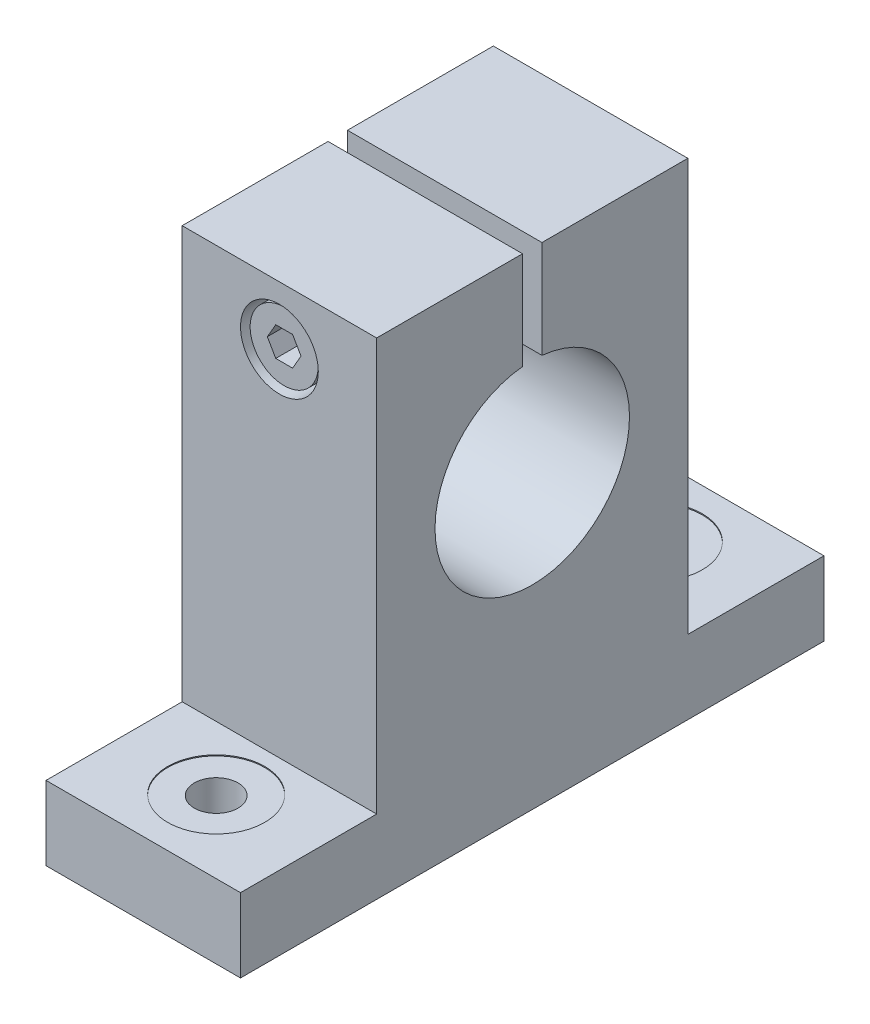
ISO-10303-21;
HEADER;
FILE_DESCRIPTION(('STEP AP214'),'2;1');
FILE_NAME('part.step','',(''),(''),'','','');
FILE_SCHEMA(('AUTOMOTIVE_DESIGN { 1 0 10303 214 1 1 1 1 }'));
ENDSEC;
DATA;
#1=APPLICATION_CONTEXT('core data for automotive mechanical design processes');
#2=APPLICATION_PROTOCOL_DEFINITION('international standard','automotive_design',2000,#1);
#3=PRODUCT_CONTEXT('',#1,'mechanical');
#4=PRODUCT('Part','Part','',(#3));
#5=PRODUCT_RELATED_PRODUCT_CATEGORY('part','',(#4));
#6=PRODUCT_DEFINITION_FORMATION('','',#4);
#7=PRODUCT_DEFINITION_CONTEXT('part definition',#1,'design');
#8=PRODUCT_DEFINITION('design','',#6,#7);
#9=PRODUCT_DEFINITION_SHAPE('','',#8);
#10=(LENGTH_UNIT() NAMED_UNIT(*) SI_UNIT(.MILLI.,.METRE.));
#11=(NAMED_UNIT(*) PLANE_ANGLE_UNIT() SI_UNIT($,.RADIAN.));
#12=(NAMED_UNIT(*) SI_UNIT($,.STERADIAN.) SOLID_ANGLE_UNIT());
#13=UNCERTAINTY_MEASURE_WITH_UNIT(LENGTH_MEASURE(1.E-05),#10,'distance_accuracy_value','');
#14=(GEOMETRIC_REPRESENTATION_CONTEXT(3) GLOBAL_UNCERTAINTY_ASSIGNED_CONTEXT((#13)) GLOBAL_UNIT_ASSIGNED_CONTEXT((#10,
#11,#12)) REPRESENTATION_CONTEXT('',''));
#15=CARTESIAN_POINT('',(0.,0.,0.));
#16=DIRECTION('',(0.,0.,1.));
#17=DIRECTION('',(1.,0.,0.));
#18=AXIS2_PLACEMENT_3D('',#15,#16,#17);
#19=CARTESIAN_POINT('',(-1.73205080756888,14.,15.51));
#20=DIRECTION('',(0.866025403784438,0.500000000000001,0.));
#21=DIRECTION('',(0.500000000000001,-0.866025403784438,0.));
#22=AXIS2_PLACEMENT_3D('',#19,#20,#21);
#23=PLANE('',#22);
#24=DIRECTION('',(0.500000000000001,-0.866025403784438,0.));
#25=VECTOR('',#24,1.);
#26=CARTESIAN_POINT('',(-1.29903810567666,13.25,15.51));
#27=LINE('',#26,#25);
#28=CARTESIAN_POINT('',(-1.73205068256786,13.9999997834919,15.51));
#29=VERTEX_POINT('',#28);
#30=CARTESIAN_POINT('',(-0.86602540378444,12.5,15.51));
#31=VERTEX_POINT('',#30);
#32=EDGE_CURVE('E580',#29,#31,#27,.T.);
#33=ORIENTED_EDGE('',*,*,#32,.T.);
#34=DIRECTION('',(0.,0.,-1.));
#35=VECTOR('',#34,1.);
#36=CARTESIAN_POINT('',(-0.86602540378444,12.5,15.51));
#37=LINE('',#36,#35);
#38=CARTESIAN_POINT('',(-0.86602540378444,12.5,12.8433333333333));
#39=VERTEX_POINT('',#38);
#40=EDGE_CURVE('E583',#39,#31,#37,.F.);
#41=ORIENTED_EDGE('',*,*,#40,.F.);
#42=DIRECTION('',(-0.500000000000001,0.866025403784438,0.));
#43=VECTOR('',#42,1.);
#44=CARTESIAN_POINT('',(-1.29903810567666,13.25,12.8433333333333));
#45=LINE('',#44,#43);
#46=CARTESIAN_POINT('',(-1.73205077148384,14.0000000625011,12.8433333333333));
#47=VERTEX_POINT('',#46);
#48=EDGE_CURVE('E588',#39,#47,#45,.T.);
#49=ORIENTED_EDGE('',*,*,#48,.T.);
#50=DIRECTION('',(0.,0.,-1.));
#51=VECTOR('',#50,1.);
#52=CARTESIAN_POINT('',(-1.73205080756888,14.,15.51));
#53=LINE('',#52,#51);
#54=EDGE_CURVE('E586',#29,#47,#53,.T.);
#55=ORIENTED_EDGE('',*,*,#54,.F.);
#56=EDGE_LOOP('',(#33,#41,#49,#55));
#57=FACE_BOUND('',#56,.T.);
#58=ADVANCED_FACE('F16',(#57),#23,.T.);
#59=CARTESIAN_POINT('',(-0.86602540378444,12.5,15.51));
#60=DIRECTION('',(0.,1.,0.));
#61=DIRECTION('',(1.,0.,0.));
#62=AXIS2_PLACEMENT_3D('',#59,#60,#61);
#63=PLANE('',#62);
#64=DIRECTION('',(1.,0.,0.));
#65=VECTOR('',#64,1.);
#66=CARTESIAN_POINT('',(0.,12.5,15.51));
#67=LINE('',#66,#65);
#68=CARTESIAN_POINT('',(0.86602540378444,12.5,15.51));
#69=VERTEX_POINT('',#68);
#70=EDGE_CURVE('E590',#31,#69,#67,.T.);
#71=ORIENTED_EDGE('',*,*,#70,.T.);
#72=DIRECTION('',(0.,0.,-1.));
#73=VECTOR('',#72,1.);
#74=CARTESIAN_POINT('',(0.86602540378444,12.5,15.51));
#75=LINE('',#74,#73);
#76=CARTESIAN_POINT('',(0.86602540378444,12.5,12.8433333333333));
#77=VERTEX_POINT('',#76);
#78=EDGE_CURVE('E657',#77,#69,#75,.F.);
#79=ORIENTED_EDGE('',*,*,#78,.F.);
#80=DIRECTION('',(1.,0.,0.));
#81=VECTOR('',#80,1.);
#82=CARTESIAN_POINT('',(0.,12.5,12.8433333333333));
#83=LINE('',#82,#81);
#84=EDGE_CURVE('E599',#39,#77,#83,.T.);
#85=ORIENTED_EDGE('',*,*,#84,.F.);
#86=ORIENTED_EDGE('',*,*,#40,.T.);
#87=EDGE_LOOP('',(#71,#79,#85,#86));
#88=FACE_BOUND('',#87,.T.);
#89=ADVANCED_FACE('F598',(#88),#63,.T.);
#90=CARTESIAN_POINT('',(-0.86602540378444,15.5,15.51));
#91=DIRECTION('',(0.866025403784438,-0.500000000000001,0.));
#92=DIRECTION('',(-0.500000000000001,-0.866025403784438,0.));
#93=AXIS2_PLACEMENT_3D('',#90,#91,#92);
#94=PLANE('',#93);
#95=DIRECTION('',(-0.500000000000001,-0.866025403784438,0.));
#96=VECTOR('',#95,1.);
#97=CARTESIAN_POINT('',(-1.29903810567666,14.75,15.51));
#98=LINE('',#97,#96);
#99=CARTESIAN_POINT('',(-0.86602540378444,15.5,15.51));
#100=VERTEX_POINT('',#99);
#101=EDGE_CURVE('E596',#100,#29,#98,.T.);
#102=ORIENTED_EDGE('',*,*,#101,.T.);
#103=ORIENTED_EDGE('',*,*,#54,.T.);
#104=CARTESIAN_POINT('',(-0.86602540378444,15.5,12.8433333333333));
#105=CARTESIAN_POINT('',(-0.902109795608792,15.4375,12.8433333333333));
#106=CARTESIAN_POINT('',(-0.938194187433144,15.375,12.8433333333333));
#107=CARTESIAN_POINT('',(-1.01036297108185,15.25,12.8433333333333));
#108=CARTESIAN_POINT('',(-1.0464473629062,15.1875,12.8433333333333));
#109=CARTESIAN_POINT('',(-1.1186161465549,15.0625,12.8433333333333));
#110=CARTESIAN_POINT('',(-1.15470053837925,15.,12.8433333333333));
#111=CARTESIAN_POINT('',(-1.22686932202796,14.875,12.8433333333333));
#112=CARTESIAN_POINT('',(-1.26295371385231,14.8125,12.8433333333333));
#113=CARTESIAN_POINT('',(-1.33512249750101,14.6875,12.8433333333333));
#114=CARTESIAN_POINT('',(-1.37120688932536,14.625,12.8433333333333));
#115=CARTESIAN_POINT('',(-1.44337567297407,14.5,12.8433333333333));
#116=CARTESIAN_POINT('',(-1.47946006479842,14.4375,12.8433333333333));
#117=CARTESIAN_POINT('',(-1.55162884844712,14.3125,12.8433333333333));
#118=CARTESIAN_POINT('',(-1.58771324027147,14.25,12.8433333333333));
#119=CARTESIAN_POINT('',(-1.65988202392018,14.125,12.8433333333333));
#120=CARTESIAN_POINT('',(-1.69596641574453,14.0625,12.8433333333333));
#121=CARTESIAN_POINT('',(-1.73205080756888,14.,12.8433333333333));
#122=B_SPLINE_CURVE_WITH_KNOTS('',3,(#104,#105,#106,#107,#108,#109,#110,#111,#112,#113,#114,
#115,#116,#117,#118,#119,#120,#121),.UNSPECIFIED.,.F.,.F.,(4,2,2,2,2,2,2,2,4),(0.,
0.21650635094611,0.43301270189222,0.64951905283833,0.86602540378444,1.08253175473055,
1.29903810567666,1.51554445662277,1.73205080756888),.UNSPECIFIED.);
#123=CARTESIAN_POINT('',(-0.86602540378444,15.5,12.8433333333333));
#124=VERTEX_POINT('',#123);
#125=EDGE_CURVE('E604',#124,#47,#122,.T.);
#126=ORIENTED_EDGE('',*,*,#125,.F.);
#127=DIRECTION('',(0.,0.,-1.));
#128=VECTOR('',#127,1.);
#129=CARTESIAN_POINT('',(-0.86602540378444,15.5,15.51));
#130=LINE('',#129,#128);
#131=EDGE_CURVE('E642',#100,#124,#130,.T.);
#132=ORIENTED_EDGE('',*,*,#131,.F.);
#133=EDGE_LOOP('',(#102,#103,#126,#132));
#134=FACE_BOUND('',#133,.T.);
#135=ADVANCED_FACE('F619',(#134),#94,.T.);
#136=CARTESIAN_POINT('',(-1.73205080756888,12.5,12.8433333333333));
#137=DIRECTION('',(0.,0.,1.));
#138=DIRECTION('',(1.,0.,0.));
#139=AXIS2_PLACEMENT_3D('',#136,#137,#138);
#140=PLANE('',#139);
#141=ORIENTED_EDGE('',*,*,#48,.F.);
#142=ORIENTED_EDGE('',*,*,#84,.T.);
#143=DIRECTION('',(-0.500000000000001,-0.866025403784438,0.));
#144=VECTOR('',#143,1.);
#145=CARTESIAN_POINT('',(1.29903810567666,13.25,12.8433333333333));
#146=LINE('',#145,#144);
#147=CARTESIAN_POINT('',(1.7320507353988,13.9999998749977,12.8433333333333));
#148=VERTEX_POINT('',#147);
#149=EDGE_CURVE('E656',#148,#77,#146,.T.);
#150=ORIENTED_EDGE('',*,*,#149,.F.);
#151=DIRECTION('',(0.500000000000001,-0.866025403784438,0.));
#152=VECTOR('',#151,1.);
#153=CARTESIAN_POINT('',(1.29903810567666,14.75,12.8433333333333));
#154=LINE('',#153,#152);
#155=CARTESIAN_POINT('',(0.86602540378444,15.5,12.8433333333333));
#156=VERTEX_POINT('',#155);
#157=EDGE_CURVE('E645',#156,#148,#154,.T.);
#158=ORIENTED_EDGE('',*,*,#157,.F.);
#159=DIRECTION('',(1.,0.,0.));
#160=VECTOR('',#159,1.);
#161=CARTESIAN_POINT('',(0.,15.5,12.8433333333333));
#162=LINE('',#161,#160);
#163=EDGE_CURVE('E643',#124,#156,#162,.T.);
#164=ORIENTED_EDGE('',*,*,#163,.F.);
#165=ORIENTED_EDGE('',*,*,#125,.T.);
#166=EDGE_LOOP('',(#141,#142,#150,#158,#164,#165));
#167=FACE_BOUND('',#166,.T.);
#168=ADVANCED_FACE('F621',(#167),#140,.T.);
#169=CARTESIAN_POINT('',(0.86602540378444,12.5,15.51));
#170=DIRECTION('',(-0.866025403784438,0.500000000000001,0.));
#171=DIRECTION('',(0.500000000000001,0.866025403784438,0.));
#172=AXIS2_PLACEMENT_3D('',#169,#170,#171);
#173=PLANE('',#172);
#174=DIRECTION('',(0.500000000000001,0.866025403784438,0.));
#175=VECTOR('',#174,1.);
#176=CARTESIAN_POINT('',(1.29903810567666,13.25,15.51));
#177=LINE('',#176,#175);
#178=CARTESIAN_POINT('',(1.73205074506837,13.9999998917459,15.51));
#179=VERTEX_POINT('',#178);
#180=EDGE_CURVE('E592',#69,#179,#177,.T.);
#181=ORIENTED_EDGE('',*,*,#180,.T.);
#182=DIRECTION('',(0.,0.,-1.));
#183=VECTOR('',#182,1.);
#184=CARTESIAN_POINT('',(1.73205080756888,14.,15.51));
#185=LINE('',#184,#183);
#186=EDGE_CURVE('E343',#148,#179,#185,.F.);
#187=ORIENTED_EDGE('',*,*,#186,.F.);
#188=ORIENTED_EDGE('',*,*,#149,.T.);
#189=ORIENTED_EDGE('',*,*,#78,.T.);
#190=EDGE_LOOP('',(#181,#187,#188,#189));
#191=FACE_BOUND('',#190,.T.);
#192=ADVANCED_FACE('F624',(#191),#173,.T.);
#193=CARTESIAN_POINT('',(0.86602540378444,15.5,15.51));
#194=DIRECTION('',(0.,-1.,0.));
#195=DIRECTION('',(-1.,0.,0.));
#196=AXIS2_PLACEMENT_3D('',#193,#194,#195);
#197=PLANE('',#196);
#198=DIRECTION('',(-1.,0.,0.));
#199=VECTOR('',#198,1.);
#200=CARTESIAN_POINT('',(0.,15.5,15.51));
#201=LINE('',#200,#199);
#202=CARTESIAN_POINT('',(0.86602540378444,15.5,15.51));
#203=VERTEX_POINT('',#202);
#204=EDGE_CURVE('E639',#203,#100,#201,.T.);
#205=ORIENTED_EDGE('',*,*,#204,.T.);
#206=ORIENTED_EDGE('',*,*,#131,.T.);
#207=ORIENTED_EDGE('',*,*,#163,.T.);
#208=DIRECTION('',(0.,0.,-1.));
#209=VECTOR('',#208,1.);
#210=CARTESIAN_POINT('',(0.86602540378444,15.5,15.51));
#211=LINE('',#210,#209);
#212=EDGE_CURVE('E335',#203,#156,#211,.T.);
#213=ORIENTED_EDGE('',*,*,#212,.F.);
#214=EDGE_LOOP('',(#205,#206,#207,#213));
#215=FACE_BOUND('',#214,.T.);
#216=ADVANCED_FACE('F627',(#215),#197,.T.);
#217=CARTESIAN_POINT('',(1.73205080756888,14.,15.51));
#218=DIRECTION('',(-0.866025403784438,-0.500000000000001,0.));
#219=DIRECTION('',(-0.500000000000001,0.866025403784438,0.));
#220=AXIS2_PLACEMENT_3D('',#217,#218,#219);
#221=PLANE('',#220);
#222=CARTESIAN_POINT('',(0.86602540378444,15.5,15.51));
#223=CARTESIAN_POINT('',(0.902109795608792,15.4375,15.51));
#224=CARTESIAN_POINT('',(0.938194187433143,15.375,15.51));
#225=CARTESIAN_POINT('',(1.01036297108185,15.25,15.51));
#226=CARTESIAN_POINT('',(1.0464473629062,15.1875,15.51));
#227=CARTESIAN_POINT('',(1.1186161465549,15.0625,15.51));
#228=CARTESIAN_POINT('',(1.15470053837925,15.,15.51));
#229=CARTESIAN_POINT('',(1.22686932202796,14.875,15.51));
#230=CARTESIAN_POINT('',(1.26295371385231,14.8125,15.51));
#231=CARTESIAN_POINT('',(1.33512249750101,14.6875,15.51));
#232=CARTESIAN_POINT('',(1.37120688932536,14.625,15.51));
#233=CARTESIAN_POINT('',(1.44337567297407,14.5,15.51));
#234=CARTESIAN_POINT('',(1.47946006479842,14.4375,15.51));
#235=CARTESIAN_POINT('',(1.55162884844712,14.3125,15.51));
#236=CARTESIAN_POINT('',(1.58771324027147,14.25,15.51));
#237=CARTESIAN_POINT('',(1.65988202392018,14.125,15.51));
#238=CARTESIAN_POINT('',(1.69596641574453,14.0625,15.51));
#239=CARTESIAN_POINT('',(1.73205080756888,14.,15.51));
#240=B_SPLINE_CURVE_WITH_KNOTS('',3,(#222,#223,#224,#225,#226,#227,#228,#229,#230,#231,#232,
#233,#234,#235,#236,#237,#238,#239),.UNSPECIFIED.,.F.,.F.,(4,2,2,2,2,2,2,2,4),(0.,
0.21650635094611,0.43301270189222,0.64951905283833,0.866025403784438,1.08253175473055,
1.29903810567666,1.51554445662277,1.73205080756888),.UNSPECIFIED.);
#241=EDGE_CURVE('E331',#203,#179,#240,.T.);
#242=ORIENTED_EDGE('',*,*,#241,.F.);
#243=ORIENTED_EDGE('',*,*,#212,.T.);
#244=ORIENTED_EDGE('',*,*,#157,.T.);
#245=ORIENTED_EDGE('',*,*,#186,.T.);
#246=EDGE_LOOP('',(#242,#243,#244,#245));
#247=FACE_BOUND('',#246,.T.);
#248=ADVANCED_FACE('F362',(#247),#221,.T.);
#249=CARTESIAN_POINT('',(3.54200210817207,10.5,15.51));
#250=DIRECTION('',(0.,0.,1.));
#251=DIRECTION('',(0.,1.,0.));
#252=AXIS2_PLACEMENT_3D('',#249,#250,#251);
#253=PLANE('',#252);
#254=ORIENTED_EDGE('',*,*,#204,.F.);
#255=ORIENTED_EDGE('',*,*,#241,.T.);
#256=ORIENTED_EDGE('',*,*,#180,.F.);
#257=ORIENTED_EDGE('',*,*,#70,.F.);
#258=ORIENTED_EDGE('',*,*,#32,.F.);
#259=ORIENTED_EDGE('',*,*,#101,.F.);
#260=EDGE_LOOP('',(#254,#255,#256,#257,#258,#259));
#261=FACE_BOUND('',#260,.T.);
#262=CARTESIAN_POINT('',(0.,14.,15.51));
#263=DIRECTION('',(0.,0.,1.));
#264=DIRECTION('',(1.,0.,0.));
#265=AXIS2_PLACEMENT_3D('',#262,#263,#264);
#266=CIRCLE('',#265,3.5);
#267=CARTESIAN_POINT('',(3.5,14.,15.51));
#268=VERTEX_POINT('',#267);
#269=EDGE_CURVE('E20',#268,#268,#266,.F.);
#270=ORIENTED_EDGE('',*,*,#269,.F.);
#271=EDGE_LOOP('',(#270));
#272=FACE_BOUND('',#271,.T.);
#273=ADVANCED_FACE('F364',(#261,#272),#253,.T.);
#274=CARTESIAN_POINT('',(0.,14.,15.51));
#275=DIRECTION('',(0.,0.,1.));
#276=DIRECTION('',(1.,0.,0.));
#277=AXIS2_PLACEMENT_3D('',#274,#275,#276);
#278=CYLINDRICAL_SURFACE('',#277,3.5);
#279=ORIENTED_EDGE('',*,*,#269,.T.);
#280=EDGE_LOOP('',(#279));
#281=FACE_BOUND('',#280,.T.);
#282=CARTESIAN_POINT('',(0.,14.,11.511));
#283=DIRECTION('',(0.,0.,1.));
#284=DIRECTION('',(1.,0.,0.));
#285=AXIS2_PLACEMENT_3D('',#282,#283,#284);
#286=CIRCLE('',#285,3.5);
#287=CARTESIAN_POINT('',(3.5,14.,11.511));
#288=VERTEX_POINT('',#287);
#289=EDGE_CURVE('E326',#288,#288,#286,.F.);
#290=ORIENTED_EDGE('',*,*,#289,.F.);
#291=EDGE_LOOP('',(#290));
#292=FACE_BOUND('',#291,.T.);
#293=ADVANCED_FACE('F367',(#281,#292),#278,.T.);
#294=CARTESIAN_POINT('',(3.54200210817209,17.5,11.511));
#295=DIRECTION('',(0.,0.,-1.));
#296=DIRECTION('',(0.,-1.,0.));
#297=AXIS2_PLACEMENT_3D('',#294,#295,#296);
#298=PLANE('',#297);
#299=CARTESIAN_POINT('',(0.,14.,11.511));
#300=DIRECTION('',(0.,0.,1.));
#301=DIRECTION('',(1.,0.,0.));
#302=AXIS2_PLACEMENT_3D('',#299,#300,#301);
#303=CIRCLE('',#302,2.);
#304=CARTESIAN_POINT('',(2.,14.,11.511));
#305=VERTEX_POINT('',#304);
#306=EDGE_CURVE('E324',#305,#305,#303,.F.);
#307=ORIENTED_EDGE('',*,*,#306,.F.);
#308=EDGE_LOOP('',(#307));
#309=FACE_BOUND('',#308,.T.);
#310=ORIENTED_EDGE('',*,*,#289,.T.);
#311=EDGE_LOOP('',(#310));
#312=FACE_BOUND('',#311,.T.);
#313=ADVANCED_FACE('F370',(#309,#312),#298,.T.);
#314=CARTESIAN_POINT('',(1.61920421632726,15.6,-12.002));
#315=DIRECTION('',(0.,0.,-1.));
#316=DIRECTION('',(0.,-1.,0.));
#317=AXIS2_PLACEMENT_3D('',#314,#315,#316);
#318=PLANE('',#317);
#319=CARTESIAN_POINT('',(0.,14.,-12.002));
#320=DIRECTION('',(0.,0.,1.));
#321=DIRECTION('',(1.,0.,0.));
#322=AXIS2_PLACEMENT_3D('',#319,#320,#321);
#323=CIRCLE('',#322,1.6);
#324=CARTESIAN_POINT('',(1.6,14.,-12.002));
#325=VERTEX_POINT('',#324);
#326=EDGE_CURVE('E321',#325,#325,#323,.T.);
#327=ORIENTED_EDGE('',*,*,#326,.F.);
#328=EDGE_LOOP('',(#327));
#329=FACE_BOUND('',#328,.T.);
#330=ADVANCED_FACE('F373',(#329),#318,.T.);
#331=CARTESIAN_POINT('',(0.,14.,11.511));
#332=DIRECTION('',(0.,0.,1.));
#333=DIRECTION('',(1.,0.,0.));
#334=AXIS2_PLACEMENT_3D('',#331,#332,#333);
#335=CYLINDRICAL_SURFACE('',#334,2.);
#336=ORIENTED_EDGE('',*,*,#306,.T.);
#337=EDGE_LOOP('',(#336));
#338=FACE_BOUND('',#337,.T.);
#339=CARTESIAN_POINT('',(0.,14.,11.501));
#340=DIRECTION('',(0.,0.,1.));
#341=DIRECTION('',(1.,0.,0.));
#342=AXIS2_PLACEMENT_3D('',#339,#340,#341);
#343=CIRCLE('',#342,2.);
#344=CARTESIAN_POINT('',(2.,14.,11.501));
#345=VERTEX_POINT('',#344);
#346=EDGE_CURVE('E318',#345,#345,#343,.F.);
#347=ORIENTED_EDGE('',*,*,#346,.F.);
#348=EDGE_LOOP('',(#347));
#349=FACE_BOUND('',#348,.T.);
#350=ADVANCED_FACE('F377',(#338,#349),#335,.T.);
#351=CARTESIAN_POINT('',(5.,-16.,-11.));
#352=DIRECTION('',(0.,-1.,0.));
#353=DIRECTION('',(0.,0.,1.));
#354=AXIS2_PLACEMENT_3D('',#351,#352,#353);
#355=PLANE('',#354);
#356=DIRECTION('',(0.,0.,-1.));
#357=VECTOR('',#356,1.);
#358=CARTESIAN_POINT('',(5.,-16.,0.));
#359=LINE('',#358,#357);
#360=CARTESIAN_POINT('',(5.,-16.,11.));
#361=VERTEX_POINT('',#360);
#362=CARTESIAN_POINT('',(5.,-16.,-11.));
#363=VERTEX_POINT('',#362);
#364=EDGE_CURVE('E1599',#361,#363,#359,.T.);
#365=ORIENTED_EDGE('',*,*,#364,.F.);
#366=DIRECTION('',(-1.,0.,0.));
#367=VECTOR('',#366,1.);
#368=CARTESIAN_POINT('',(5.,-16.,11.));
#369=LINE('',#368,#367);
#370=CARTESIAN_POINT('',(-5.,-16.,11.));
#371=VERTEX_POINT('',#370);
#372=EDGE_CURVE('E314',#371,#361,#369,.F.);
#373=ORIENTED_EDGE('',*,*,#372,.F.);
#374=DIRECTION('',(0.,0.,1.));
#375=VECTOR('',#374,1.);
#376=CARTESIAN_POINT('',(-5.,-16.,0.));
#377=LINE('',#376,#375);
#378=CARTESIAN_POINT('',(-5.,-16.,-11.));
#379=VERTEX_POINT('',#378);
#380=EDGE_CURVE('E1612',#379,#371,#377,.T.);
#381=ORIENTED_EDGE('',*,*,#380,.F.);
#382=DIRECTION('',(-1.,0.,0.));
#383=VECTOR('',#382,1.);
#384=CARTESIAN_POINT('',(5.,-16.,-11.));
#385=LINE('',#384,#383);
#386=EDGE_CURVE('E1600',#363,#379,#385,.T.);
#387=ORIENTED_EDGE('',*,*,#386,.F.);
#388=EDGE_LOOP('',(#365,#373,#381,#387));
#389=FACE_BOUND('',#388,.T.);
#390=ADVANCED_FACE('F381',(#389),#355,.T.);
#391=CARTESIAN_POINT('',(5.04988210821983,-22.5,-17.51));
#392=DIRECTION('',(0.,1.,0.));
#393=DIRECTION('',(0.,0.,-1.));
#394=AXIS2_PLACEMENT_3D('',#391,#392,#393);
#395=PLANE('',#394);
#396=CARTESIAN_POINT('',(0.,-22.5,-22.5));
#397=DIRECTION('',(0.,-1.,0.));
#398=DIRECTION('',(0.,0.,-1.));
#399=AXIS2_PLACEMENT_3D('',#396,#397,#398);
#400=CIRCLE('',#399,2.25);
#401=CARTESIAN_POINT('',(0.,-22.5,-24.75));
#402=VERTEX_POINT('',#401);
#403=EDGE_CURVE('E315',#402,#402,#400,.F.);
#404=ORIENTED_EDGE('',*,*,#403,.F.);
#405=EDGE_LOOP('',(#404));
#406=FACE_BOUND('',#405,.T.);
#407=CARTESIAN_POINT('',(0.,-22.5,-22.5));
#408=DIRECTION('',(0.,-1.,0.));
#409=DIRECTION('',(0.,0.,-1.));
#410=AXIS2_PLACEMENT_3D('',#407,#408,#409);
#411=CIRCLE('',#410,4.99);
#412=CARTESIAN_POINT('',(0.,-22.5,-27.49));
#413=VERTEX_POINT('',#412);
#414=EDGE_CURVE('E279',#413,#413,#411,.T.);
#415=ORIENTED_EDGE('',*,*,#414,.F.);
#416=EDGE_LOOP('',(#415));
#417=FACE_BOUND('',#416,.T.);
#418=ADVANCED_FACE('F385',(#406,#417),#395,.T.);
#419=CARTESIAN_POINT('',(0.,14.,-15.601));
#420=DIRECTION('',(0.,0.,1.));
#421=DIRECTION('',(1.,0.,0.));
#422=AXIS2_PLACEMENT_3D('',#419,#420,#421);
#423=CYLINDRICAL_SURFACE('',#422,1.6);
#424=ORIENTED_EDGE('',*,*,#326,.T.);
#425=EDGE_LOOP('',(#424));
#426=FACE_BOUND('',#425,.T.);
#427=CARTESIAN_POINT('',(0.,14.,-15.601));
#428=DIRECTION('',(0.,0.,1.));
#429=DIRECTION('',(0.,1.,0.));
#430=AXIS2_PLACEMENT_3D('',#427,#428,#429);
#431=CIRCLE('',#430,1.6);
#432=CARTESIAN_POINT('',(0.,15.6,-15.601));
#433=VERTEX_POINT('',#432);
#434=EDGE_CURVE('E276',#433,#433,#431,.T.);
#435=ORIENTED_EDGE('',*,*,#434,.F.);
#436=EDGE_LOOP('',(#435));
#437=FACE_BOUND('',#436,.T.);
#438=ADVANCED_FACE('F389',(#426,#437),#423,.F.);
#439=CARTESIAN_POINT('',(4.04800210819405,10.,11.501));
#440=DIRECTION('',(0.,0.,1.));
#441=DIRECTION('',(0.,1.,0.));
#442=AXIS2_PLACEMENT_3D('',#439,#440,#441);
#443=PLANE('',#442);
#444=ORIENTED_EDGE('',*,*,#346,.T.);
#445=EDGE_LOOP('',(#444));
#446=FACE_BOUND('',#445,.T.);
#447=CARTESIAN_POINT('',(0.,14.,11.501));
#448=DIRECTION('',(0.,0.,1.));
#449=DIRECTION('',(1.,0.,0.));
#450=AXIS2_PLACEMENT_3D('',#447,#448,#449);
#451=CIRCLE('',#450,4.);
#452=CARTESIAN_POINT('',(4.,14.,11.501));
#453=VERTEX_POINT('',#452);
#454=EDGE_CURVE('E278',#453,#453,#451,.F.);
#455=ORIENTED_EDGE('',*,*,#454,.F.);
#456=EDGE_LOOP('',(#455));
#457=FACE_BOUND('',#456,.T.);
#458=ADVANCED_FACE('F393',(#446,#457),#443,.T.);
#459=CARTESIAN_POINT('',(5.04988210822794,-22.5,27.49));
#460=DIRECTION('',(0.,1.,0.));
#461=DIRECTION('',(0.,0.,-1.));
#462=AXIS2_PLACEMENT_3D('',#459,#460,#461);
#463=PLANE('',#462);
#464=CARTESIAN_POINT('',(0.,-22.5,22.5));
#465=DIRECTION('',(0.,-1.,0.));
#466=DIRECTION('',(0.,0.,-1.));
#467=AXIS2_PLACEMENT_3D('',#464,#465,#466);
#468=CIRCLE('',#467,2.25);
#469=CARTESIAN_POINT('',(0.,-22.5,20.25));
#470=VERTEX_POINT('',#469);
#471=EDGE_CURVE('E311',#470,#470,#468,.F.);
#472=ORIENTED_EDGE('',*,*,#471,.F.);
#473=EDGE_LOOP('',(#472));
#474=FACE_BOUND('',#473,.T.);
#475=CARTESIAN_POINT('',(0.,-22.5,22.5));
#476=DIRECTION('',(0.,-1.,0.));
#477=DIRECTION('',(0.,0.,-1.));
#478=AXIS2_PLACEMENT_3D('',#475,#476,#477);
#479=CIRCLE('',#478,4.99);
#480=CARTESIAN_POINT('',(0.,-22.5,17.51));
#481=VERTEX_POINT('',#480);
#482=EDGE_CURVE('E303',#481,#481,#479,.T.);
#483=ORIENTED_EDGE('',*,*,#482,.F.);
#484=EDGE_LOOP('',(#483));
#485=FACE_BOUND('',#484,.T.);
#486=ADVANCED_FACE('F397',(#474,#485),#463,.T.);
#487=CARTESIAN_POINT('',(0.,-22.5,-22.5));
#488=DIRECTION('',(0.,-1.,0.));
#489=DIRECTION('',(0.,0.,-1.));
#490=AXIS2_PLACEMENT_3D('',#487,#488,#489);
#491=CYLINDRICAL_SURFACE('',#490,2.25);
#492=ORIENTED_EDGE('',*,*,#403,.T.);
#493=EDGE_LOOP('',(#492));
#494=FACE_BOUND('',#493,.T.);
#495=CARTESIAN_POINT('',(0.,-30.,-22.5));
#496=DIRECTION('',(0.,-1.,0.));
#497=DIRECTION('',(0.,0.,-1.));
#498=AXIS2_PLACEMENT_3D('',#495,#496,#497);
#499=CIRCLE('',#498,2.25);
#500=CARTESIAN_POINT('',(0.,-30.,-24.75));
#501=VERTEX_POINT('',#500);
#502=EDGE_CURVE('E300',#501,#501,#499,.F.);
#503=ORIENTED_EDGE('',*,*,#502,.F.);
#504=EDGE_LOOP('',(#503));
#505=FACE_BOUND('',#504,.T.);
#506=ADVANCED_FACE('F401',(#494,#505),#491,.F.);
#507=CARTESIAN_POINT('',(0.,-22.5,22.5));
#508=DIRECTION('',(0.,-1.,0.));
#509=DIRECTION('',(0.,0.,-1.));
#510=AXIS2_PLACEMENT_3D('',#507,#508,#509);
#511=CYLINDRICAL_SURFACE('',#510,2.25);
#512=ORIENTED_EDGE('',*,*,#471,.T.);
#513=EDGE_LOOP('',(#512));
#514=FACE_BOUND('',#513,.T.);
#515=CARTESIAN_POINT('',(0.,-30.,22.5));
#516=DIRECTION('',(0.,-1.,0.));
#517=DIRECTION('',(0.,0.,-1.));
#518=AXIS2_PLACEMENT_3D('',#515,#516,#517);
#519=CIRCLE('',#518,2.25);
#520=CARTESIAN_POINT('',(0.,-30.,20.25));
#521=VERTEX_POINT('',#520);
#522=EDGE_CURVE('E296',#521,#521,#519,.F.);
#523=ORIENTED_EDGE('',*,*,#522,.F.);
#524=EDGE_LOOP('',(#523));
#525=FACE_BOUND('',#524,.T.);
#526=ADVANCED_FACE('F405',(#514,#525),#511,.F.);
#527=CARTESIAN_POINT('',(5.,-16.,11.));
#528=DIRECTION('',(0.,0.,-1.));
#529=DIRECTION('',(0.,-1.,0.));
#530=AXIS2_PLACEMENT_3D('',#527,#528,#529);
#531=PLANE('',#530);
#532=ORIENTED_EDGE('',*,*,#372,.T.);
#533=DIRECTION('',(0.,1.,0.));
#534=VECTOR('',#533,1.);
#535=CARTESIAN_POINT('',(5.,-30.,11.));
#536=LINE('',#535,#534);
#537=CARTESIAN_POINT('',(5.,-30.,11.));
#538=VERTEX_POINT('',#537);
#539=EDGE_CURVE('E1593',#538,#361,#536,.T.);
#540=ORIENTED_EDGE('',*,*,#539,.F.);
#541=DIRECTION('',(-1.,0.,0.));
#542=VECTOR('',#541,1.);
#543=CARTESIAN_POINT('',(10.,-30.,11.));
#544=LINE('',#543,#542);
#545=CARTESIAN_POINT('',(-5.,-30.,11.));
#546=VERTEX_POINT('',#545);
#547=EDGE_CURVE('E299',#546,#538,#544,.F.);
#548=ORIENTED_EDGE('',*,*,#547,.F.);
#549=DIRECTION('',(0.,1.,0.));
#550=VECTOR('',#549,1.);
#551=CARTESIAN_POINT('',(-5.,-30.,11.));
#552=LINE('',#551,#550);
#553=EDGE_CURVE('E310',#371,#546,#552,.F.);
#554=ORIENTED_EDGE('',*,*,#553,.F.);
#555=EDGE_LOOP('',(#532,#540,#548,#554));
#556=FACE_BOUND('',#555,.T.);
#557=ADVANCED_FACE('F409',(#556),#531,.T.);
#558=CARTESIAN_POINT('',(5.,-30.,-11.));
#559=DIRECTION('',(-1.,0.,0.));
#560=DIRECTION('',(0.,0.,1.));
#561=AXIS2_PLACEMENT_3D('',#558,#559,#560);
#562=PLANE('',#561);
#563=ORIENTED_EDGE('',*,*,#364,.T.);
#564=DIRECTION('',(0.,1.,0.));
#565=VECTOR('',#564,1.);
#566=CARTESIAN_POINT('',(5.,-23.,-11.));
#567=LINE('',#566,#565);
#568=CARTESIAN_POINT('',(5.,-30.,-11.));
#569=VERTEX_POINT('',#568);
#570=EDGE_CURVE('E1602',#569,#363,#567,.T.);
#571=ORIENTED_EDGE('',*,*,#570,.F.);
#572=DIRECTION('',(0.,0.,-1.));
#573=VECTOR('',#572,1.);
#574=CARTESIAN_POINT('',(5.,-30.,0.));
#575=LINE('',#574,#573);
#576=EDGE_CURVE('E1604',#538,#569,#575,.T.);
#577=ORIENTED_EDGE('',*,*,#576,.F.);
#578=ORIENTED_EDGE('',*,*,#539,.T.);
#579=EDGE_LOOP('',(#563,#571,#577,#578));
#580=FACE_BOUND('',#579,.T.);
#581=ADVANCED_FACE('F413',(#580),#562,.T.);
#582=CARTESIAN_POINT('',(5.,-30.,-11.));
#583=DIRECTION('',(0.,0.,1.));
#584=DIRECTION('',(0.,1.,0.));
#585=AXIS2_PLACEMENT_3D('',#582,#583,#584);
#586=PLANE('',#585);
#587=ORIENTED_EDGE('',*,*,#386,.T.);
#588=DIRECTION('',(0.,1.,0.));
#589=VECTOR('',#588,1.);
#590=CARTESIAN_POINT('',(-5.,-30.,-11.));
#591=LINE('',#590,#589);
#592=CARTESIAN_POINT('',(-5.,-30.,-11.));
#593=VERTEX_POINT('',#592);
#594=EDGE_CURVE('E1609',#593,#379,#591,.T.);
#595=ORIENTED_EDGE('',*,*,#594,.F.);
#596=DIRECTION('',(-1.,0.,0.));
#597=VECTOR('',#596,1.);
#598=CARTESIAN_POINT('',(10.,-30.,-11.));
#599=LINE('',#598,#597);
#600=EDGE_CURVE('E1618',#569,#593,#599,.T.);
#601=ORIENTED_EDGE('',*,*,#600,.F.);
#602=ORIENTED_EDGE('',*,*,#570,.T.);
#603=EDGE_LOOP('',(#587,#595,#601,#602));
#604=FACE_BOUND('',#603,.T.);
#605=ADVANCED_FACE('F417',(#604),#586,.T.);
#606=CARTESIAN_POINT('',(-5.,-30.,11.));
#607=DIRECTION('',(1.,0.,0.));
#608=DIRECTION('',(0.,0.,-1.));
#609=AXIS2_PLACEMENT_3D('',#606,#607,#608);
#610=PLANE('',#609);
#611=ORIENTED_EDGE('',*,*,#380,.T.);
#612=ORIENTED_EDGE('',*,*,#553,.T.);
#613=DIRECTION('',(0.,0.,1.));
#614=VECTOR('',#613,1.);
#615=CARTESIAN_POINT('',(-5.,-30.,0.));
#616=LINE('',#615,#614);
#617=EDGE_CURVE('E198',#593,#546,#616,.T.);
#618=ORIENTED_EDGE('',*,*,#617,.F.);
#619=ORIENTED_EDGE('',*,*,#594,.T.);
#620=EDGE_LOOP('',(#611,#612,#618,#619));
#621=FACE_BOUND('',#620,.T.);
#622=ADVANCED_FACE('F421',(#621),#610,.T.);
#623=CARTESIAN_POINT('',(0.,-22.4,-22.5));
#624=DIRECTION('',(0.,-1.,0.));
#625=DIRECTION('',(0.,0.,-1.));
#626=AXIS2_PLACEMENT_3D('',#623,#624,#625);
#627=CYLINDRICAL_SURFACE('',#626,4.99);
#628=ORIENTED_EDGE('',*,*,#414,.T.);
#629=EDGE_LOOP('',(#628));
#630=FACE_BOUND('',#629,.T.);
#631=CARTESIAN_POINT('',(0.,-22.4,-22.5));
#632=DIRECTION('',(0.,-1.,0.));
#633=DIRECTION('',(0.,0.,-1.));
#634=AXIS2_PLACEMENT_3D('',#631,#632,#633);
#635=CIRCLE('',#634,4.99);
#636=CARTESIAN_POINT('',(0.,-22.4,-27.49));
#637=VERTEX_POINT('',#636);
#638=EDGE_CURVE('E179',#637,#637,#635,.T.);
#639=ORIENTED_EDGE('',*,*,#638,.F.);
#640=EDGE_LOOP('',(#639));
#641=FACE_BOUND('',#640,.T.);
#642=ADVANCED_FACE('F425',(#630,#641),#627,.F.);
#643=CARTESIAN_POINT('',(0.,14.,-16.));
#644=DIRECTION('',(0.,0.,-1.));
#645=DIRECTION('',(-1.,0.,0.));
#646=AXIS2_PLACEMENT_3D('',#643,#644,#645);
#647=CONICAL_SURFACE('',#646,1.999,0.785398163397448);
#648=ORIENTED_EDGE('',*,*,#434,.T.);
#649=EDGE_LOOP('',(#648));
#650=FACE_BOUND('',#649,.T.);
#651=CARTESIAN_POINT('',(0.,14.,-16.));
#652=DIRECTION('',(0.,0.,-1.));
#653=DIRECTION('',(-1.,0.,0.));
#654=AXIS2_PLACEMENT_3D('',#651,#652,#653);
#655=CIRCLE('',#654,1.999);
#656=CARTESIAN_POINT('',(-1.999,14.,-16.));
#657=VERTEX_POINT('',#656);
#658=EDGE_CURVE('E169',#657,#657,#655,.F.);
#659=ORIENTED_EDGE('',*,*,#658,.F.);
#660=EDGE_LOOP('',(#659));
#661=FACE_BOUND('',#660,.T.);
#662=ADVANCED_FACE('F429',(#650,#661),#647,.F.);
#663=CARTESIAN_POINT('',(0.,14.,11.501));
#664=DIRECTION('',(0.,0.,1.));
#665=DIRECTION('',(1.,0.,0.));
#666=AXIS2_PLACEMENT_3D('',#663,#664,#665);
#667=CYLINDRICAL_SURFACE('',#666,4.);
#668=ORIENTED_EDGE('',*,*,#454,.T.);
#669=EDGE_LOOP('',(#668));
#670=FACE_BOUND('',#669,.T.);
#671=CARTESIAN_POINT('',(0.,14.,16.));
#672=DIRECTION('',(0.,0.,1.));
#673=DIRECTION('',(1.,0.,0.));
#674=AXIS2_PLACEMENT_3D('',#671,#672,#673);
#675=CIRCLE('',#674,4.);
#676=CARTESIAN_POINT('',(4.,14.,16.));
#677=VERTEX_POINT('',#676);
#678=EDGE_CURVE('E128',#677,#677,#675,.F.);
#679=ORIENTED_EDGE('',*,*,#678,.F.);
#680=EDGE_LOOP('',(#679));
#681=FACE_BOUND('',#680,.T.);
#682=ADVANCED_FACE('F433',(#670,#681),#667,.F.);
#683=CARTESIAN_POINT('',(0.,-22.4,22.5));
#684=DIRECTION('',(0.,-1.,0.));
#685=DIRECTION('',(0.,0.,-1.));
#686=AXIS2_PLACEMENT_3D('',#683,#684,#685);
#687=CYLINDRICAL_SURFACE('',#686,4.99);
#688=ORIENTED_EDGE('',*,*,#482,.T.);
#689=EDGE_LOOP('',(#688));
#690=FACE_BOUND('',#689,.T.);
#691=CARTESIAN_POINT('',(0.,-22.4,22.5));
#692=DIRECTION('',(0.,-1.,0.));
#693=DIRECTION('',(0.,0.,-1.));
#694=AXIS2_PLACEMENT_3D('',#691,#692,#693);
#695=CIRCLE('',#694,4.99);
#696=CARTESIAN_POINT('',(0.,-22.4,17.51));
#697=VERTEX_POINT('',#696);
#698=EDGE_CURVE('E207',#697,#697,#695,.T.);
#699=ORIENTED_EDGE('',*,*,#698,.F.);
#700=EDGE_LOOP('',(#699));
#701=FACE_BOUND('',#700,.T.);
#702=ADVANCED_FACE('F437',(#690,#701),#687,.F.);
#703=CARTESIAN_POINT('',(0.,14.,1.));
#704=DIRECTION('',(0.,0.,1.));
#705=DIRECTION('',(1.,0.,0.));
#706=AXIS2_PLACEMENT_3D('',#703,#704,#705);
#707=CYLINDRICAL_SURFACE('',#706,2.);
#708=CARTESIAN_POINT('',(0.,14.,-1.));
#709=DIRECTION('',(0.,0.,1.));
#710=DIRECTION('',(1.,0.,0.));
#711=AXIS2_PLACEMENT_3D('',#708,#709,#710);
#712=CIRCLE('',#711,2.);
#713=CARTESIAN_POINT('',(2.,14.,-1.));
#714=VERTEX_POINT('',#713);
#715=EDGE_CURVE('E129',#714,#714,#712,.F.);
#716=ORIENTED_EDGE('',*,*,#715,.F.);
#717=EDGE_LOOP('',(#716));
#718=FACE_BOUND('',#717,.T.);
#719=CARTESIAN_POINT('',(0.,14.,1.));
#720=DIRECTION('',(0.,0.,1.));
#721=DIRECTION('',(1.,0.,0.));
#722=AXIS2_PLACEMENT_3D('',#719,#720,#721);
#723=CIRCLE('',#722,2.);
#724=CARTESIAN_POINT('',(2.,14.,1.));
#725=VERTEX_POINT('',#724);
#726=EDGE_CURVE('E203',#725,#725,#723,.T.);
#727=ORIENTED_EDGE('',*,*,#726,.F.);
#728=EDGE_LOOP('',(#727));
#729=FACE_BOUND('',#728,.T.);
#730=ADVANCED_FACE('F441',(#718,#729),#707,.T.);
#731=CARTESIAN_POINT('',(10.,-30.,-30.));
#732=DIRECTION('',(0.,-1.,0.));
#733=DIRECTION('',(0.,0.,1.));
#734=AXIS2_PLACEMENT_3D('',#731,#732,#733);
#735=PLANE('',#734);
#736=ORIENTED_EDGE('',*,*,#600,.T.);
#737=ORIENTED_EDGE('',*,*,#617,.T.);
#738=ORIENTED_EDGE('',*,*,#547,.T.);
#739=ORIENTED_EDGE('',*,*,#576,.T.);
#740=EDGE_LOOP('',(#736,#737,#738,#739));
#741=FACE_BOUND('',#740,.T.);
#742=ORIENTED_EDGE('',*,*,#522,.T.);
#743=EDGE_LOOP('',(#742));
#744=FACE_BOUND('',#743,.T.);
#745=ORIENTED_EDGE('',*,*,#502,.T.);
#746=EDGE_LOOP('',(#745));
#747=FACE_BOUND('',#746,.T.);
#748=DIRECTION('',(0.,0.,-1.));
#749=VECTOR('',#748,1.);
#750=CARTESIAN_POINT('',(10.,-30.,0.));
#751=LINE('',#750,#749);
#752=CARTESIAN_POINT('',(10.,-30.,30.));
#753=VERTEX_POINT('',#752);
#754=CARTESIAN_POINT('',(10.,-30.,-30.));
#755=VERTEX_POINT('',#754);
#756=EDGE_CURVE('E194',#753,#755,#751,.T.);
#757=ORIENTED_EDGE('',*,*,#756,.F.);
#758=DIRECTION('',(-1.,0.,0.));
#759=VECTOR('',#758,1.);
#760=CARTESIAN_POINT('',(10.,-30.,30.));
#761=LINE('',#760,#759);
#762=CARTESIAN_POINT('',(-10.,-30.,30.));
#763=VERTEX_POINT('',#762);
#764=EDGE_CURVE('E97',#763,#753,#761,.F.);
#765=ORIENTED_EDGE('',*,*,#764,.F.);
#766=DIRECTION('',(0.,0.,1.));
#767=VECTOR('',#766,1.);
#768=CARTESIAN_POINT('',(-10.,-30.,0.));
#769=LINE('',#768,#767);
#770=CARTESIAN_POINT('',(-10.,-30.,-30.));
#771=VERTEX_POINT('',#770);
#772=EDGE_CURVE('E242',#771,#763,#769,.T.);
#773=ORIENTED_EDGE('',*,*,#772,.F.);
#774=DIRECTION('',(-1.,0.,0.));
#775=VECTOR('',#774,1.);
#776=CARTESIAN_POINT('',(10.,-30.,-30.));
#777=LINE('',#776,#775);
#778=EDGE_CURVE('E89',#755,#771,#777,.T.);
#779=ORIENTED_EDGE('',*,*,#778,.F.);
#780=EDGE_LOOP('',(#757,#765,#773,#779));
#781=FACE_BOUND('',#780,.T.);
#782=ADVANCED_FACE('F445',(#741,#744,#747,#781),#735,.T.);
#783=CARTESIAN_POINT('',(10.,-22.4,-30.));
#784=DIRECTION('',(0.,0.,-1.));
#785=DIRECTION('',(0.,-1.,0.));
#786=AXIS2_PLACEMENT_3D('',#783,#784,#785);
#787=PLANE('',#786);
#788=DIRECTION('',(0.,1.,0.));
#789=VECTOR('',#788,1.);
#790=CARTESIAN_POINT('',(10.,-30.,-30.));
#791=LINE('',#790,#789);
#792=CARTESIAN_POINT('',(10.,-22.4,-30.));
#793=VERTEX_POINT('',#792);
#794=EDGE_CURVE('E184',#755,#793,#791,.T.);
#795=ORIENTED_EDGE('',*,*,#794,.F.);
#796=ORIENTED_EDGE('',*,*,#778,.T.);
#797=DIRECTION('',(0.,1.,0.));
#798=VECTOR('',#797,1.);
#799=CARTESIAN_POINT('',(-10.,-30.,-30.));
#800=LINE('',#799,#798);
#801=CARTESIAN_POINT('',(-10.,-22.4,-30.));
#802=VERTEX_POINT('',#801);
#803=EDGE_CURVE('E152',#802,#771,#800,.F.);
#804=ORIENTED_EDGE('',*,*,#803,.F.);
#805=DIRECTION('',(-1.,0.,0.));
#806=VECTOR('',#805,1.);
#807=CARTESIAN_POINT('',(10.,-22.4,-30.));
#808=LINE('',#807,#806);
#809=EDGE_CURVE('E187',#793,#802,#808,.T.);
#810=ORIENTED_EDGE('',*,*,#809,.F.);
#811=EDGE_LOOP('',(#795,#796,#804,#810));
#812=FACE_BOUND('',#811,.T.);
#813=ADVANCED_FACE('F449',(#812),#787,.T.);
#814=CARTESIAN_POINT('',(10.,-22.4,-16.));
#815=DIRECTION('',(0.,1.,0.));
#816=DIRECTION('',(0.,0.,-1.));
#817=AXIS2_PLACEMENT_3D('',#814,#815,#816);
#818=PLANE('',#817);
#819=ORIENTED_EDGE('',*,*,#638,.T.);
#820=EDGE_LOOP('',(#819));
#821=FACE_BOUND('',#820,.T.);
#822=DIRECTION('',(0.,0.,1.));
#823=VECTOR('',#822,1.);
#824=CARTESIAN_POINT('',(10.,-22.4,0.));
#825=LINE('',#824,#823);
#826=CARTESIAN_POINT('',(10.,-22.4,-16.));
#827=VERTEX_POINT('',#826);
#828=EDGE_CURVE('E174',#793,#827,#825,.T.);
#829=ORIENTED_EDGE('',*,*,#828,.F.);
#830=ORIENTED_EDGE('',*,*,#809,.T.);
#831=DIRECTION('',(0.,0.,-1.));
#832=VECTOR('',#831,1.);
#833=CARTESIAN_POINT('',(-10.,-22.4,0.));
#834=LINE('',#833,#832);
#835=CARTESIAN_POINT('',(-10.,-22.4,-16.));
#836=VERTEX_POINT('',#835);
#837=EDGE_CURVE('E256',#836,#802,#834,.T.);
#838=ORIENTED_EDGE('',*,*,#837,.F.);
#839=DIRECTION('',(-1.,0.,0.));
#840=VECTOR('',#839,1.);
#841=CARTESIAN_POINT('',(10.,-22.4,-16.));
#842=LINE('',#841,#840);
#843=EDGE_CURVE('E177',#827,#836,#842,.T.);
#844=ORIENTED_EDGE('',*,*,#843,.F.);
#845=EDGE_LOOP('',(#829,#830,#838,#844));
#846=FACE_BOUND('',#845,.T.);
#847=ADVANCED_FACE('F453',(#821,#846),#818,.T.);
#848=CARTESIAN_POINT('',(10.,20.,-16.));
#849=DIRECTION('',(0.,0.,-1.));
#850=DIRECTION('',(0.,-1.,0.));
#851=AXIS2_PLACEMENT_3D('',#848,#849,#850);
#852=PLANE('',#851);
#853=ORIENTED_EDGE('',*,*,#658,.T.);
#854=EDGE_LOOP('',(#853));
#855=FACE_BOUND('',#854,.T.);
#856=DIRECTION('',(0.,1.,0.));
#857=VECTOR('',#856,1.);
#858=CARTESIAN_POINT('',(10.,-30.,-16.));
#859=LINE('',#858,#857);
#860=CARTESIAN_POINT('',(10.,20.,-16.));
#861=VERTEX_POINT('',#860);
#862=EDGE_CURVE('E165',#827,#861,#859,.T.);
#863=ORIENTED_EDGE('',*,*,#862,.F.);
#864=ORIENTED_EDGE('',*,*,#843,.T.);
#865=DIRECTION('',(0.,1.,0.));
#866=VECTOR('',#865,1.);
#867=CARTESIAN_POINT('',(-10.,-30.,-16.));
#868=LINE('',#867,#866);
#869=CARTESIAN_POINT('',(-10.,20.,-16.));
#870=VERTEX_POINT('',#869);
#871=EDGE_CURVE('E260',#870,#836,#868,.F.);
#872=ORIENTED_EDGE('',*,*,#871,.F.);
#873=DIRECTION('',(-1.,0.,0.));
#874=VECTOR('',#873,1.);
#875=CARTESIAN_POINT('',(10.,20.,-16.));
#876=LINE('',#875,#874);
#877=EDGE_CURVE('E160',#861,#870,#876,.T.);
#878=ORIENTED_EDGE('',*,*,#877,.F.);
#879=EDGE_LOOP('',(#863,#864,#872,#878));
#880=FACE_BOUND('',#879,.T.);
#881=ADVANCED_FACE('F456',(#855,#880),#852,.T.);
#882=CARTESIAN_POINT('',(10.,20.,-1.));
#883=DIRECTION('',(0.,1.,0.));
#884=DIRECTION('',(0.,0.,-1.));
#885=AXIS2_PLACEMENT_3D('',#882,#883,#884);
#886=PLANE('',#885);
#887=DIRECTION('',(0.,0.,1.));
#888=VECTOR('',#887,1.);
#889=CARTESIAN_POINT('',(10.,20.,0.));
#890=LINE('',#889,#888);
#891=CARTESIAN_POINT('',(10.,20.,-0.999999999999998));
#892=VERTEX_POINT('',#891);
#893=EDGE_CURVE('E156',#861,#892,#890,.T.);
#894=ORIENTED_EDGE('',*,*,#893,.F.);
#895=ORIENTED_EDGE('',*,*,#877,.T.);
#896=DIRECTION('',(0.,0.,-1.));
#897=VECTOR('',#896,1.);
#898=CARTESIAN_POINT('',(-10.,20.,0.));
#899=LINE('',#898,#897);
#900=CARTESIAN_POINT('',(-10.,20.,-1.));
#901=VERTEX_POINT('',#900);
#902=EDGE_CURVE('E223',#901,#870,#899,.T.);
#903=ORIENTED_EDGE('',*,*,#902,.F.);
#904=DIRECTION('',(-1.,0.,0.));
#905=VECTOR('',#904,1.);
#906=CARTESIAN_POINT('',(10.,20.,-1.));
#907=LINE('',#906,#905);
#908=EDGE_CURVE('E59',#892,#901,#907,.T.);
#909=ORIENTED_EDGE('',*,*,#908,.F.);
#910=EDGE_LOOP('',(#894,#895,#903,#909));
#911=FACE_BOUND('',#910,.T.);
#912=ADVANCED_FACE('F460',(#911),#886,.T.);
#913=CARTESIAN_POINT('',(10.,9.9498743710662,-1.));
#914=DIRECTION('',(0.,0.,1.));
#915=DIRECTION('',(0.,1.,0.));
#916=AXIS2_PLACEMENT_3D('',#913,#914,#915);
#917=PLANE('',#916);
#918=ORIENTED_EDGE('',*,*,#715,.T.);
#919=EDGE_LOOP('',(#918));
#920=FACE_BOUND('',#919,.T.);
#921=DIRECTION('',(0.,1.,0.));
#922=VECTOR('',#921,1.);
#923=CARTESIAN_POINT('',(10.,-30.,-0.999999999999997));
#924=LINE('',#923,#922);
#925=CARTESIAN_POINT('',(10.,9.9498743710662,-0.999999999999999));
#926=VERTEX_POINT('',#925);
#927=EDGE_CURVE('E142',#892,#926,#924,.F.);
#928=ORIENTED_EDGE('',*,*,#927,.F.);
#929=ORIENTED_EDGE('',*,*,#908,.T.);
#930=DIRECTION('',(0.,1.,0.));
#931=VECTOR('',#930,1.);
#932=CARTESIAN_POINT('',(-10.,-30.,-0.999999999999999));
#933=LINE('',#932,#931);
#934=CARTESIAN_POINT('',(-10.,9.9498743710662,-1.));
#935=VERTEX_POINT('',#934);
#936=EDGE_CURVE('E217',#935,#901,#933,.T.);
#937=ORIENTED_EDGE('',*,*,#936,.F.);
#938=DIRECTION('',(-1.,0.,0.));
#939=VECTOR('',#938,1.);
#940=CARTESIAN_POINT('',(0.,9.9498743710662,-1.));
#941=LINE('',#940,#939);
#942=EDGE_CURVE('E150',#926,#935,#941,.T.);
#943=ORIENTED_EDGE('',*,*,#942,.F.);
#944=EDGE_LOOP('',(#928,#929,#937,#943));
#945=FACE_BOUND('',#944,.T.);
#946=ADVANCED_FACE('F464',(#920,#945),#917,.T.);
#947=CARTESIAN_POINT('',(10.,20.,16.));
#948=DIRECTION('',(0.,1.,0.));
#949=DIRECTION('',(0.,0.,-1.));
#950=AXIS2_PLACEMENT_3D('',#947,#948,#949);
#951=PLANE('',#950);
#952=DIRECTION('',(0.,0.,1.));
#953=VECTOR('',#952,1.);
#954=CARTESIAN_POINT('',(10.,20.,0.));
#955=LINE('',#954,#953);
#956=CARTESIAN_POINT('',(10.,20.,0.999999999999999));
#957=VERTEX_POINT('',#956);
#958=CARTESIAN_POINT('',(10.,20.,16.));
#959=VERTEX_POINT('',#958);
#960=EDGE_CURVE('E122',#957,#959,#955,.T.);
#961=ORIENTED_EDGE('',*,*,#960,.F.);
#962=DIRECTION('',(-1.,0.,0.));
#963=VECTOR('',#962,1.);
#964=CARTESIAN_POINT('',(10.,20.,1.));
#965=LINE('',#964,#963);
#966=CARTESIAN_POINT('',(-10.,20.,0.999999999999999));
#967=VERTEX_POINT('',#966);
#968=EDGE_CURVE('E285',#967,#957,#965,.F.);
#969=ORIENTED_EDGE('',*,*,#968,.F.);
#970=DIRECTION('',(0.,0.,-1.));
#971=VECTOR('',#970,1.);
#972=CARTESIAN_POINT('',(-10.,20.,0.));
#973=LINE('',#972,#971);
#974=CARTESIAN_POINT('',(-10.,20.,16.));
#975=VERTEX_POINT('',#974);
#976=EDGE_CURVE('E124',#975,#967,#973,.T.);
#977=ORIENTED_EDGE('',*,*,#976,.F.);
#978=DIRECTION('',(-1.,0.,0.));
#979=VECTOR('',#978,1.);
#980=CARTESIAN_POINT('',(10.,20.,16.));
#981=LINE('',#980,#979);
#982=EDGE_CURVE('E117',#959,#975,#981,.T.);
#983=ORIENTED_EDGE('',*,*,#982,.F.);
#984=EDGE_LOOP('',(#961,#969,#977,#983));
#985=FACE_BOUND('',#984,.T.);
#986=ADVANCED_FACE('F119',(#985),#951,.T.);
#987=CARTESIAN_POINT('',(10.,-22.4,16.));
#988=DIRECTION('',(0.,0.,1.));
#989=DIRECTION('',(0.,1.,0.));
#990=AXIS2_PLACEMENT_3D('',#987,#988,#989);
#991=PLANE('',#990);
#992=ORIENTED_EDGE('',*,*,#678,.T.);
#993=EDGE_LOOP('',(#992));
#994=FACE_BOUND('',#993,.T.);
#995=DIRECTION('',(0.,1.,0.));
#996=VECTOR('',#995,1.);
#997=CARTESIAN_POINT('',(10.,-30.,16.));
#998=LINE('',#997,#996);
#999=CARTESIAN_POINT('',(10.,-22.4,16.));
#1000=VERTEX_POINT('',#999);
#1001=EDGE_CURVE('E132',#959,#1000,#998,.F.);
#1002=ORIENTED_EDGE('',*,*,#1001,.F.);
#1003=ORIENTED_EDGE('',*,*,#982,.T.);
#1004=DIRECTION('',(0.,1.,0.));
#1005=VECTOR('',#1004,1.);
#1006=CARTESIAN_POINT('',(-10.,-30.,16.));
#1007=LINE('',#1006,#1005);
#1008=CARTESIAN_POINT('',(-10.,-22.4,16.));
#1009=VERTEX_POINT('',#1008);
#1010=EDGE_CURVE('E218',#1009,#975,#1007,.T.);
#1011=ORIENTED_EDGE('',*,*,#1010,.F.);
#1012=DIRECTION('',(-1.,0.,0.));
#1013=VECTOR('',#1012,1.);
#1014=CARTESIAN_POINT('',(10.,-22.4,16.));
#1015=LINE('',#1014,#1013);
#1016=EDGE_CURVE('E134',#1000,#1009,#1015,.T.);
#1017=ORIENTED_EDGE('',*,*,#1016,.F.);
#1018=EDGE_LOOP('',(#1002,#1003,#1011,#1017));
#1019=FACE_BOUND('',#1018,.T.);
#1020=ADVANCED_FACE('F133',(#994,#1019),#991,.T.);
#1021=CARTESIAN_POINT('',(10.,-22.4,30.));
#1022=DIRECTION('',(0.,1.,0.));
#1023=DIRECTION('',(0.,0.,-1.));
#1024=AXIS2_PLACEMENT_3D('',#1021,#1022,#1023);
#1025=PLANE('',#1024);
#1026=ORIENTED_EDGE('',*,*,#698,.T.);
#1027=EDGE_LOOP('',(#1026));
#1028=FACE_BOUND('',#1027,.T.);
#1029=DIRECTION('',(0.,0.,1.));
#1030=VECTOR('',#1029,1.);
#1031=CARTESIAN_POINT('',(10.,-22.4,0.));
#1032=LINE('',#1031,#1030);
#1033=CARTESIAN_POINT('',(10.,-22.4,30.));
#1034=VERTEX_POINT('',#1033);
#1035=EDGE_CURVE('E138',#1000,#1034,#1032,.T.);
#1036=ORIENTED_EDGE('',*,*,#1035,.F.);
#1037=ORIENTED_EDGE('',*,*,#1016,.T.);
#1038=DIRECTION('',(0.,0.,-1.));
#1039=VECTOR('',#1038,1.);
#1040=CARTESIAN_POINT('',(-10.,-22.4,0.));
#1041=LINE('',#1040,#1039);
#1042=CARTESIAN_POINT('',(-10.,-22.4,30.));
#1043=VERTEX_POINT('',#1042);
#1044=EDGE_CURVE('E227',#1043,#1009,#1041,.T.);
#1045=ORIENTED_EDGE('',*,*,#1044,.F.);
#1046=DIRECTION('',(-1.,0.,0.));
#1047=VECTOR('',#1046,1.);
#1048=CARTESIAN_POINT('',(10.,-22.4,30.));
#1049=LINE('',#1048,#1047);
#1050=EDGE_CURVE('E153',#1034,#1043,#1049,.T.);
#1051=ORIENTED_EDGE('',*,*,#1050,.F.);
#1052=EDGE_LOOP('',(#1036,#1037,#1045,#1051));
#1053=FACE_BOUND('',#1052,.T.);
#1054=ADVANCED_FACE('F472',(#1028,#1053),#1025,.T.);
#1055=CARTESIAN_POINT('',(10.,-30.,30.));
#1056=DIRECTION('',(0.,0.,1.));
#1057=DIRECTION('',(0.,1.,0.));
#1058=AXIS2_PLACEMENT_3D('',#1055,#1056,#1057);
#1059=PLANE('',#1058);
#1060=DIRECTION('',(0.,1.,0.));
#1061=VECTOR('',#1060,1.);
#1062=CARTESIAN_POINT('',(10.,-30.,30.));
#1063=LINE('',#1062,#1061);
#1064=EDGE_CURVE('E210',#1034,#753,#1063,.F.);
#1065=ORIENTED_EDGE('',*,*,#1064,.F.);
#1066=ORIENTED_EDGE('',*,*,#1050,.T.);
#1067=DIRECTION('',(0.,1.,0.));
#1068=VECTOR('',#1067,1.);
#1069=CARTESIAN_POINT('',(-10.,-30.,30.));
#1070=LINE('',#1069,#1068);
#1071=EDGE_CURVE('E234',#763,#1043,#1070,.T.);
#1072=ORIENTED_EDGE('',*,*,#1071,.F.);
#1073=ORIENTED_EDGE('',*,*,#764,.T.);
#1074=EDGE_LOOP('',(#1065,#1066,#1072,#1073));
#1075=FACE_BOUND('',#1074,.T.);
#1076=ADVANCED_FACE('F476',(#1075),#1059,.T.);
#1077=CARTESIAN_POINT('',(-10.,-30.,-30.));
#1078=DIRECTION('',(-1.,0.,0.));
#1079=DIRECTION('',(0.,0.,1.));
#1080=AXIS2_PLACEMENT_3D('',#1077,#1078,#1079);
#1081=PLANE('',#1080);
#1082=ORIENTED_EDGE('',*,*,#871,.T.);
#1083=ORIENTED_EDGE('',*,*,#837,.T.);
#1084=ORIENTED_EDGE('',*,*,#803,.T.);
#1085=ORIENTED_EDGE('',*,*,#772,.T.);
#1086=ORIENTED_EDGE('',*,*,#1071,.T.);
#1087=ORIENTED_EDGE('',*,*,#1044,.T.);
#1088=ORIENTED_EDGE('',*,*,#1010,.T.);
#1089=ORIENTED_EDGE('',*,*,#976,.T.);
#1090=DIRECTION('',(0.,1.,0.));
#1091=VECTOR('',#1090,1.);
#1092=CARTESIAN_POINT('',(-10.,14.9749371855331,1.));
#1093=LINE('',#1092,#1091);
#1094=CARTESIAN_POINT('',(-10.,9.9498743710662,1.));
#1095=VERTEX_POINT('',#1094);
#1096=EDGE_CURVE('E259',#1095,#967,#1093,.T.);
#1097=ORIENTED_EDGE('',*,*,#1096,.F.);
#1098=CARTESIAN_POINT('',(-10.,0.,0.));
#1099=DIRECTION('',(-1.,0.,0.));
#1100=DIRECTION('',(0.,0.,1.));
#1101=AXIS2_PLACEMENT_3D('',#1098,#1099,#1100);
#1102=CIRCLE('',#1101,10.);
#1103=EDGE_CURVE('E213',#935,#1095,#1102,.T.);
#1104=ORIENTED_EDGE('',*,*,#1103,.F.);
#1105=ORIENTED_EDGE('',*,*,#936,.T.);
#1106=ORIENTED_EDGE('',*,*,#902,.T.);
#1107=EDGE_LOOP('',(#1082,#1083,#1084,#1085,#1086,#1087,#1088,#1089,#1097,#1104,#1105,#1106));
#1108=FACE_BOUND('',#1107,.T.);
#1109=ADVANCED_FACE('F480',(#1108),#1081,.T.);
#1110=CARTESIAN_POINT('',(10.,20.,1.));
#1111=DIRECTION('',(0.,0.,-1.));
#1112=DIRECTION('',(0.,-1.,0.));
#1113=AXIS2_PLACEMENT_3D('',#1110,#1111,#1112);
#1114=PLANE('',#1113);
#1115=ORIENTED_EDGE('',*,*,#726,.T.);
#1116=EDGE_LOOP('',(#1115));
#1117=FACE_BOUND('',#1116,.T.);
#1118=DIRECTION('',(0.,1.,0.));
#1119=VECTOR('',#1118,1.);
#1120=CARTESIAN_POINT('',(10.,-30.,0.999999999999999));
#1121=LINE('',#1120,#1119);
#1122=CARTESIAN_POINT('',(10.,9.9498743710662,1.));
#1123=VERTEX_POINT('',#1122);
#1124=EDGE_CURVE('E35',#1123,#957,#1121,.T.);
#1125=ORIENTED_EDGE('',*,*,#1124,.F.);
#1126=DIRECTION('',(1.,0.,0.));
#1127=VECTOR('',#1126,1.);
#1128=CARTESIAN_POINT('',(0.,9.9498743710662,1.));
#1129=LINE('',#1128,#1127);
#1130=EDGE_CURVE('E26',#1095,#1123,#1129,.T.);
#1131=ORIENTED_EDGE('',*,*,#1130,.F.);
#1132=ORIENTED_EDGE('',*,*,#1096,.T.);
#1133=ORIENTED_EDGE('',*,*,#968,.T.);
#1134=EDGE_LOOP('',(#1125,#1131,#1132,#1133));
#1135=FACE_BOUND('',#1134,.T.);
#1136=ADVANCED_FACE('F484',(#1117,#1135),#1114,.T.);
#1137=CARTESIAN_POINT('',(10.,-30.,30.));
#1138=DIRECTION('',(1.,0.,0.));
#1139=DIRECTION('',(0.,0.,-1.));
#1140=AXIS2_PLACEMENT_3D('',#1137,#1138,#1139);
#1141=PLANE('',#1140);
#1142=ORIENTED_EDGE('',*,*,#1035,.T.);
#1143=ORIENTED_EDGE('',*,*,#1064,.T.);
#1144=ORIENTED_EDGE('',*,*,#756,.T.);
#1145=ORIENTED_EDGE('',*,*,#794,.T.);
#1146=ORIENTED_EDGE('',*,*,#828,.T.);
#1147=ORIENTED_EDGE('',*,*,#862,.T.);
#1148=ORIENTED_EDGE('',*,*,#893,.T.);
#1149=ORIENTED_EDGE('',*,*,#927,.T.);
#1150=CARTESIAN_POINT('',(10.,0.,0.));
#1151=DIRECTION('',(-1.,0.,0.));
#1152=DIRECTION('',(0.,0.,1.));
#1153=AXIS2_PLACEMENT_3D('',#1150,#1151,#1152);
#1154=CIRCLE('',#1153,10.);
#1155=EDGE_CURVE('E11',#1123,#926,#1154,.F.);
#1156=ORIENTED_EDGE('',*,*,#1155,.F.);
#1157=ORIENTED_EDGE('',*,*,#1124,.T.);
#1158=ORIENTED_EDGE('',*,*,#960,.T.);
#1159=ORIENTED_EDGE('',*,*,#1001,.T.);
#1160=EDGE_LOOP('',(#1142,#1143,#1144,#1145,#1146,#1147,#1148,#1149,#1156,#1157,#1158,#1159));
#1161=FACE_BOUND('',#1160,.T.);
#1162=ADVANCED_FACE('F140',(#1161),#1141,.T.);
#1163=CARTESIAN_POINT('',(10.,0.,0.));
#1164=DIRECTION('',(-1.,0.,0.));
#1165=DIRECTION('',(0.,0.,1.));
#1166=AXIS2_PLACEMENT_3D('',#1163,#1164,#1165);
#1167=CYLINDRICAL_SURFACE('',#1166,10.);
#1168=ORIENTED_EDGE('',*,*,#1130,.T.);
#1169=ORIENTED_EDGE('',*,*,#1155,.T.);
#1170=ORIENTED_EDGE('',*,*,#942,.T.);
#1171=ORIENTED_EDGE('',*,*,#1103,.T.);
#1172=EDGE_LOOP('',(#1168,#1169,#1170,#1171));
#1173=FACE_BOUND('',#1172,.T.);
#1174=ADVANCED_FACE('F18',(#1173),#1167,.F.);
#1175=CLOSED_SHELL('',(#58,#89,#135,#168,#192,#216,#248,#273,#293,#313,#330,#350,#390,#418,#438,
#458,#486,#506,#526,#557,#581,#605,#622,#642,#662,#682,#702,#730,#782,#813,#847,#881,#912,#946,
#986,#1020,#1054,#1076,#1109,#1136,#1162,#1174));
#1176=MANIFOLD_SOLID_BREP('B1',#1175);
#1177=ADVANCED_BREP_SHAPE_REPRESENTATION('',(#18,#1176),#14);
#1178=SHAPE_DEFINITION_REPRESENTATION(#9,#1177);
ENDSEC;
END-ISO-10303-21;
